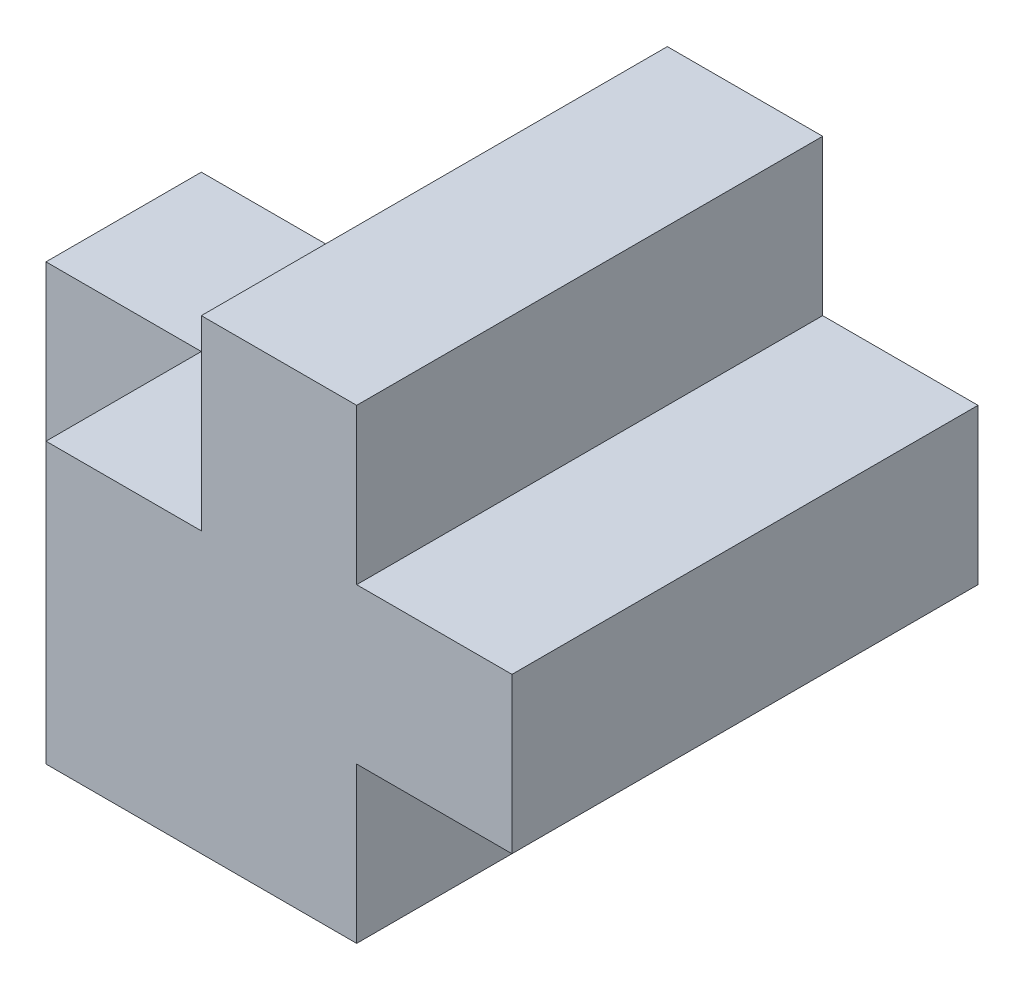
from build123d import *

# Parameters (mm, degrees)
EXTRUDE_1_DEPTH = 90
EXTRUDE_2_DEPTH = 90
EXTRUDE_4_DEPTH = 60


with BuildPart() as part:
    # Sketch 1 → Extrude 1 (new body)
    with BuildSketch(Plane.XY):
        Polygon((0, 0), (0, 75), (50, 75), (50, 25), (100, 25), (100, -25), (50, -25), (50, -75), (0, -75), align=None)
    extrude(amount=-EXTRUDE_1_DEPTH)

    # Sketch 2 → Extrude 2 (add)
    with BuildSketch(Plane.XZ.offset(75)):
        Polygon((0, -90), (-50, -90), (-50, -40), (-100, -40), (-100, 10), (-50, 10), (-50, 60), (0, 60), align=None)
    extrude(amount=-EXTRUDE_2_DEPTH)

    # Sketch 4 → Extrude 4 (add)
    with BuildSketch(Plane.XY):
        Polygon((0, 75), (50, 75), (50, 25), (100, 25), (100, -25), (50, -25), (50, -75), (0, -75), align=None)
    extrude(amount=EXTRUDE_4_DEPTH)


solid = part.part
